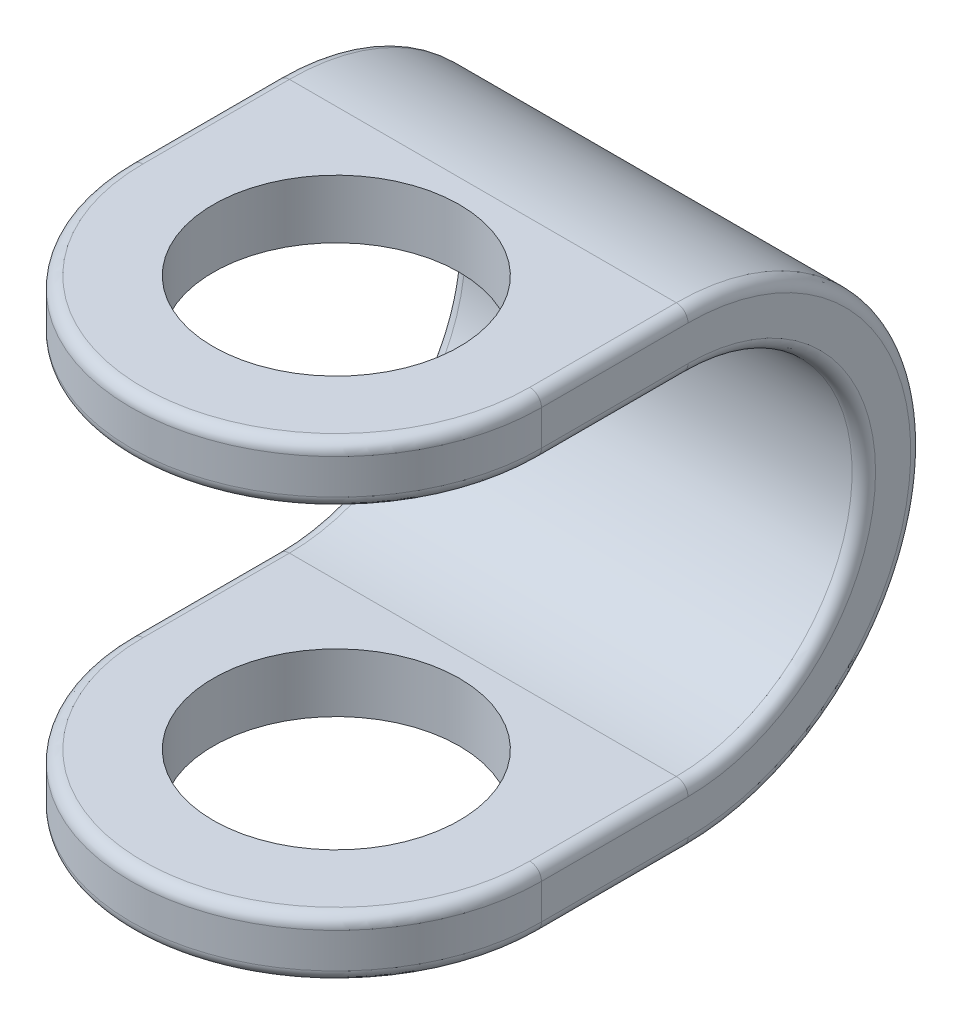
from build123d import *

# Parameters (mm, degrees)
EXTRUDE1_DEPTH     = 80
FILLET1_RADIUS     = 40
FILLET1_LENGTH     = 70
SHELL1_T           = -10
SKETCH2_R          = 21
CUT_EXTRUDE1_DEPTH = 109.857705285
FILLET2_R          = 2


with BuildPart() as part:
    # Sketch1 → Extrude1 (new body)
    with BuildSketch(Plane(origin=(0, 0, 0), x_dir=(1, 0, 0), z_dir=(0, 1, 0))):
        with BuildLine():
            Line((-35, 65), (35, 65))
            Line((35, 65), (35, 0))
            ThreePointArc((35, 0), (0, -35), (-35, 0))
            Line((-35, 0), (-35, 65))
        make_face()
    extrude(amount=-EXTRUDE1_DEPTH)

    # Fillet1: full round fillet: the end face becomes a half cylinder, R = half its width
    fillet1_face = Plane((0, -40, -65), x_dir=(-1, 0, 0), z_dir=(0, 0, -1))  # on the end face: x along it, z out of the body
    fillet1_slab = fillet1_face.offset(-FILLET1_RADIUS / 2) * Box(FILLET1_LENGTH, 2 * FILLET1_RADIUS, FILLET1_RADIUS, mode=Mode.PRIVATE)  # the body's end, R deep
    fillet1_round = Plane((0, -40, -25), x_dir=(0, 0, -1), z_dir=(-1, 0, 0)) * Cylinder(FILLET1_RADIUS, FILLET1_LENGTH, mode=Mode.PRIVATE)  # its axis R under the face
    add(fillet1_slab - fillet1_round, mode=Mode.SUBTRACT)

    # Shell1
    shell1_openings = [part.faces().sort_by_distance(p)[0] for p in [
        (35, -40, -28.91437927),
        (0, -40, 35),
        (-35, -40, -28.91437927),
    ]]
    offset(amount=SHELL1_T, openings=shell1_openings, kind=Kind.INTERSECTION)

    # Sketch2 → Cut-Extrude1 (cut, through all)
    with BuildSketch(Plane(origin=(0, 0, 0), x_dir=(-1, 0, 0), z_dir=(0, 1, 0))):
        with Locations(Location((0, 0, 0), (0, 0, 90))):
            Circle(SKETCH2_R)
    extrude(amount=-CUT_EXTRUDE1_DEPTH, mode=Mode.SUBTRACT)

    # Fillet2
    fillet2_edges = [part.edges().sort_by_distance(p)[0] for p in [
        (35, -80, -12.5),
        (-35, 0, -12.5),
        (-35, -80, -12.5),
        (35, -40, -65),
        (-35, -40, -65),
        (-35, -40, -55),
        (-35, -70, -12.5),
        (35, -70, -12.5),
        (35, -40, -55),
        (0, -70, 35),
        (35, -10, -12.5),
        (-35, -10, -12.5),
        (0, -10, 35),
        (35, 0, -12.5),
        (0, 0, 35),
        (0, -80, 35),
    ]]
    fillet(fillet2_edges, radius=FILLET2_R)


solid = part.part
